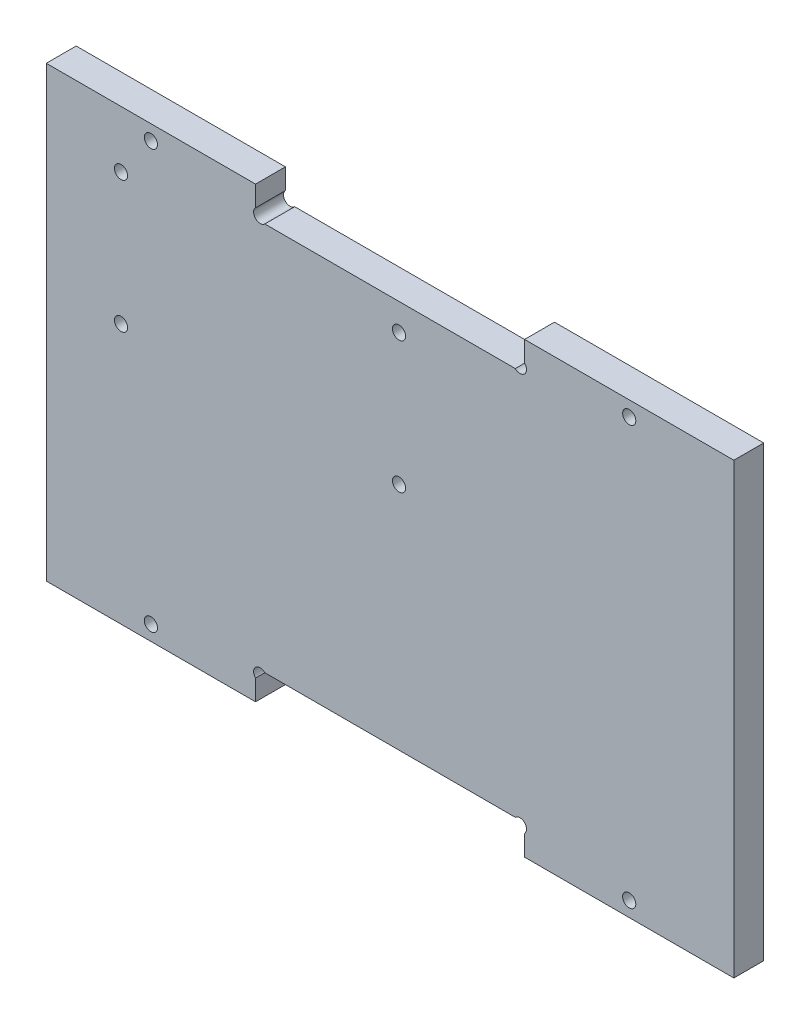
ISO-10303-21;
HEADER;
FILE_DESCRIPTION(('STEP AP214'),'2;1');
FILE_NAME('part.step','',(''),(''),'','','');
FILE_SCHEMA(('AUTOMOTIVE_DESIGN { 1 0 10303 214 1 1 1 1 }'));
ENDSEC;
DATA;
#1=APPLICATION_CONTEXT('core data for automotive mechanical design processes');
#2=APPLICATION_PROTOCOL_DEFINITION('international standard','automotive_design',2000,#1);
#3=PRODUCT_CONTEXT('',#1,'mechanical');
#4=PRODUCT('Part','Part','',(#3));
#5=PRODUCT_RELATED_PRODUCT_CATEGORY('part','',(#4));
#6=PRODUCT_DEFINITION_FORMATION('','',#4);
#7=PRODUCT_DEFINITION_CONTEXT('part definition',#1,'design');
#8=PRODUCT_DEFINITION('design','',#6,#7);
#9=PRODUCT_DEFINITION_SHAPE('','',#8);
#10=(LENGTH_UNIT() NAMED_UNIT(*) SI_UNIT(.MILLI.,.METRE.));
#11=(NAMED_UNIT(*) PLANE_ANGLE_UNIT() SI_UNIT($,.RADIAN.));
#12=(NAMED_UNIT(*) SI_UNIT($,.STERADIAN.) SOLID_ANGLE_UNIT());
#13=UNCERTAINTY_MEASURE_WITH_UNIT(LENGTH_MEASURE(1.E-05),#10,'distance_accuracy_value','');
#14=(GEOMETRIC_REPRESENTATION_CONTEXT(3) GLOBAL_UNCERTAINTY_ASSIGNED_CONTEXT((#13)) GLOBAL_UNIT_ASSIGNED_CONTEXT((#10,
#11,#12)) REPRESENTATION_CONTEXT('',''));
#15=CARTESIAN_POINT('',(0.,0.,0.));
#16=DIRECTION('',(0.,0.,1.));
#17=DIRECTION('',(1.,0.,0.));
#18=AXIS2_PLACEMENT_3D('',#15,#16,#17);
#19=CARTESIAN_POINT('',(0.,75.,5.));
#20=DIRECTION('',(0.,0.,-1.));
#21=DIRECTION('',(-1.,0.,0.));
#22=AXIS2_PLACEMENT_3D('',#19,#20,#21);
#23=PLANE('',#22);
#24=CARTESIAN_POINT('',(97.5,72.5,5.));
#25=DIRECTION('',(0.,0.,-1.));
#26=DIRECTION('',(-1.,0.,0.));
#27=AXIS2_PLACEMENT_3D('',#24,#25,#26);
#28=CIRCLE('',#27,1.1);
#29=CARTESIAN_POINT('',(96.4,72.5,5.));
#30=VERTEX_POINT('',#29);
#31=EDGE_CURVE('E319',#30,#30,#28,.T.);
#32=ORIENTED_EDGE('',*,*,#31,.T.);
#33=EDGE_LOOP('',(#32));
#34=FACE_BOUND('',#33,.T.);
#35=CARTESIAN_POINT('',(17.5,72.5,5.));
#36=DIRECTION('',(0.,0.,-1.));
#37=DIRECTION('',(-1.,0.,0.));
#38=AXIS2_PLACEMENT_3D('',#35,#36,#37);
#39=CIRCLE('',#38,1.1);
#40=CARTESIAN_POINT('',(16.4,72.5,5.));
#41=VERTEX_POINT('',#40);
#42=EDGE_CURVE('E162',#41,#41,#39,.F.);
#43=ORIENTED_EDGE('',*,*,#42,.F.);
#44=EDGE_LOOP('',(#43));
#45=FACE_BOUND('',#44,.T.);
#46=CARTESIAN_POINT('',(35.7778174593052,4.2221825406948,5.));
#47=DIRECTION('',(0.,0.,-1.));
#48=DIRECTION('',(-1.,0.,0.));
#49=AXIS2_PLACEMENT_3D('',#46,#47,#48);
#50=CIRCLE('',#49,1.1);
#51=CARTESIAN_POINT('',(36.5556349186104,5.,5.));
#52=VERTEX_POINT('',#51);
#53=CARTESIAN_POINT('',(35.,3.44436508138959,5.));
#54=VERTEX_POINT('',#53);
#55=EDGE_CURVE('E48',#52,#54,#50,.F.);
#56=ORIENTED_EDGE('',*,*,#55,.F.);
#57=DIRECTION('',(-1.,0.,0.));
#58=VECTOR('',#57,1.);
#59=CARTESIAN_POINT('',(80.,5.,5.));
#60=LINE('',#59,#58);
#61=CARTESIAN_POINT('',(78.4443650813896,5.,5.));
#62=VERTEX_POINT('',#61);
#63=EDGE_CURVE('E160',#62,#52,#60,.T.);
#64=ORIENTED_EDGE('',*,*,#63,.F.);
#65=CARTESIAN_POINT('',(79.2221825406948,4.22218254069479,5.));
#66=DIRECTION('',(0.,0.,-1.));
#67=DIRECTION('',(-1.,0.,0.));
#68=AXIS2_PLACEMENT_3D('',#65,#66,#67);
#69=CIRCLE('',#68,1.10000000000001);
#70=CARTESIAN_POINT('',(80.,3.44436508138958,5.));
#71=VERTEX_POINT('',#70);
#72=EDGE_CURVE('E56',#71,#62,#69,.F.);
#73=ORIENTED_EDGE('',*,*,#72,.F.);
#74=DIRECTION('',(0.,1.,0.));
#75=VECTOR('',#74,1.);
#76=CARTESIAN_POINT('',(80.,0.,5.));
#77=LINE('',#76,#75);
#78=CARTESIAN_POINT('',(80.,0.,5.));
#79=VERTEX_POINT('',#78);
#80=EDGE_CURVE('E277',#79,#71,#77,.T.);
#81=ORIENTED_EDGE('',*,*,#80,.F.);
#82=DIRECTION('',(1.,0.,0.));
#83=VECTOR('',#82,1.);
#84=CARTESIAN_POINT('',(0.,0.,5.));
#85=LINE('',#84,#83);
#86=CARTESIAN_POINT('',(115.,0.,5.));
#87=VERTEX_POINT('',#86);
#88=EDGE_CURVE('E228',#79,#87,#85,.T.);
#89=ORIENTED_EDGE('',*,*,#88,.T.);
#90=DIRECTION('',(0.,1.,0.));
#91=VECTOR('',#90,1.);
#92=CARTESIAN_POINT('',(115.,0.,5.));
#93=LINE('',#92,#91);
#94=CARTESIAN_POINT('',(115.,75.,5.));
#95=VERTEX_POINT('',#94);
#96=EDGE_CURVE('E233',#87,#95,#93,.T.);
#97=ORIENTED_EDGE('',*,*,#96,.T.);
#98=DIRECTION('',(-1.,0.,0.));
#99=VECTOR('',#98,1.);
#100=CARTESIAN_POINT('',(0.,75.,5.));
#101=LINE('',#100,#99);
#102=CARTESIAN_POINT('',(80.,75.,5.));
#103=VERTEX_POINT('',#102);
#104=EDGE_CURVE('E236',#95,#103,#101,.T.);
#105=ORIENTED_EDGE('',*,*,#104,.T.);
#106=DIRECTION('',(0.,1.,0.));
#107=VECTOR('',#106,1.);
#108=CARTESIAN_POINT('',(80.,75.,5.));
#109=LINE('',#108,#107);
#110=CARTESIAN_POINT('',(80.,71.5556349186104,5.));
#111=VERTEX_POINT('',#110);
#112=EDGE_CURVE('E183',#111,#103,#109,.T.);
#113=ORIENTED_EDGE('',*,*,#112,.F.);
#114=CARTESIAN_POINT('',(79.2221825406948,70.7778174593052,5.));
#115=DIRECTION('',(0.,0.,-1.));
#116=DIRECTION('',(-1.,0.,0.));
#117=AXIS2_PLACEMENT_3D('',#114,#115,#116);
#118=CIRCLE('',#117,1.10000000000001);
#119=CARTESIAN_POINT('',(78.4443650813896,70.,5.));
#120=VERTEX_POINT('',#119);
#121=EDGE_CURVE('E294',#120,#111,#118,.F.);
#122=ORIENTED_EDGE('',*,*,#121,.F.);
#123=DIRECTION('',(1.,0.,0.));
#124=VECTOR('',#123,1.);
#125=CARTESIAN_POINT('',(80.,70.,5.));
#126=LINE('',#125,#124);
#127=CARTESIAN_POINT('',(36.5556349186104,70.,5.));
#128=VERTEX_POINT('',#127);
#129=EDGE_CURVE('E195',#128,#120,#126,.T.);
#130=ORIENTED_EDGE('',*,*,#129,.F.);
#131=CARTESIAN_POINT('',(35.7778174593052,70.7778174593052,5.));
#132=DIRECTION('',(0.,0.,-1.));
#133=DIRECTION('',(-1.,0.,0.));
#134=AXIS2_PLACEMENT_3D('',#131,#132,#133);
#135=CIRCLE('',#134,1.1);
#136=CARTESIAN_POINT('',(35.,71.5556349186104,5.));
#137=VERTEX_POINT('',#136);
#138=EDGE_CURVE('E287',#137,#128,#135,.F.);
#139=ORIENTED_EDGE('',*,*,#138,.F.);
#140=DIRECTION('',(0.,-1.,0.));
#141=VECTOR('',#140,1.);
#142=CARTESIAN_POINT('',(35.,75.,5.));
#143=LINE('',#142,#141);
#144=CARTESIAN_POINT('',(35.,75.,5.));
#145=VERTEX_POINT('',#144);
#146=EDGE_CURVE('E179',#145,#137,#143,.T.);
#147=ORIENTED_EDGE('',*,*,#146,.F.);
#148=CARTESIAN_POINT('',(0.,75.,5.));
#149=VERTEX_POINT('',#148);
#150=EDGE_CURVE('E235',#145,#149,#101,.T.);
#151=ORIENTED_EDGE('',*,*,#150,.T.);
#152=DIRECTION('',(0.,-1.,0.));
#153=VECTOR('',#152,1.);
#154=CARTESIAN_POINT('',(0.,0.,5.));
#155=LINE('',#154,#153);
#156=CARTESIAN_POINT('',(0.,0.,5.));
#157=VERTEX_POINT('',#156);
#158=EDGE_CURVE('E225',#149,#157,#155,.T.);
#159=ORIENTED_EDGE('',*,*,#158,.T.);
#160=CARTESIAN_POINT('',(35.,0.,5.));
#161=VERTEX_POINT('',#160);
#162=EDGE_CURVE('E230',#157,#161,#85,.T.);
#163=ORIENTED_EDGE('',*,*,#162,.T.);
#164=DIRECTION('',(0.,-1.,0.));
#165=VECTOR('',#164,1.);
#166=CARTESIAN_POINT('',(35.,0.,5.));
#167=LINE('',#166,#165);
#168=EDGE_CURVE('E285',#54,#161,#167,.T.);
#169=ORIENTED_EDGE('',*,*,#168,.F.);
#170=EDGE_LOOP('',(#56,#64,#73,#81,#89,#97,#105,#113,#122,#130,#139,#147,#151,#159,#163,#169));
#171=FACE_BOUND('',#170,.T.);
#172=CARTESIAN_POINT('',(12.5,43.5,5.));
#173=DIRECTION('',(0.,0.,1.));
#174=DIRECTION('',(1.,0.,0.));
#175=AXIS2_PLACEMENT_3D('',#172,#173,#174);
#176=CIRCLE('',#175,1.1);
#177=CARTESIAN_POINT('',(13.6,43.5,5.));
#178=VERTEX_POINT('',#177);
#179=EDGE_CURVE('E201',#178,#178,#176,.T.);
#180=ORIENTED_EDGE('',*,*,#179,.F.);
#181=EDGE_LOOP('',(#180));
#182=FACE_BOUND('',#181,.T.);
#183=CARTESIAN_POINT('',(59.,43.5,5.));
#184=DIRECTION('',(0.,0.,1.));
#185=DIRECTION('',(1.,0.,0.));
#186=AXIS2_PLACEMENT_3D('',#183,#184,#185);
#187=CIRCLE('',#186,1.1);
#188=CARTESIAN_POINT('',(60.1,43.5,5.));
#189=VERTEX_POINT('',#188);
#190=EDGE_CURVE('E207',#189,#189,#187,.T.);
#191=ORIENTED_EDGE('',*,*,#190,.F.);
#192=EDGE_LOOP('',(#191));
#193=FACE_BOUND('',#192,.T.);
#194=CARTESIAN_POINT('',(59.,65.5,5.));
#195=DIRECTION('',(0.,0.,1.));
#196=DIRECTION('',(1.,0.,0.));
#197=AXIS2_PLACEMENT_3D('',#194,#195,#196);
#198=CIRCLE('',#197,1.10000000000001);
#199=CARTESIAN_POINT('',(60.1,65.5,5.));
#200=VERTEX_POINT('',#199);
#201=EDGE_CURVE('E213',#200,#200,#198,.T.);
#202=ORIENTED_EDGE('',*,*,#201,.F.);
#203=EDGE_LOOP('',(#202));
#204=FACE_BOUND('',#203,.T.);
#205=CARTESIAN_POINT('',(12.5,65.5,5.));
#206=DIRECTION('',(0.,0.,1.));
#207=DIRECTION('',(1.,0.,0.));
#208=AXIS2_PLACEMENT_3D('',#205,#206,#207);
#209=CIRCLE('',#208,1.1);
#210=CARTESIAN_POINT('',(13.6,65.5,5.));
#211=VERTEX_POINT('',#210);
#212=EDGE_CURVE('E219',#211,#211,#209,.T.);
#213=ORIENTED_EDGE('',*,*,#212,.F.);
#214=EDGE_LOOP('',(#213));
#215=FACE_BOUND('',#214,.T.);
#216=CARTESIAN_POINT('',(97.5,2.5,5.));
#217=DIRECTION('',(0.,0.,-1.));
#218=DIRECTION('',(-1.,0.,0.));
#219=AXIS2_PLACEMENT_3D('',#216,#217,#218);
#220=CIRCLE('',#219,1.1);
#221=CARTESIAN_POINT('',(96.4,2.5,5.));
#222=VERTEX_POINT('',#221);
#223=EDGE_CURVE('E322',#222,#222,#220,.F.);
#224=ORIENTED_EDGE('',*,*,#223,.F.);
#225=EDGE_LOOP('',(#224));
#226=FACE_BOUND('',#225,.T.);
#227=CARTESIAN_POINT('',(17.5,2.5,5.));
#228=DIRECTION('',(0.,0.,-1.));
#229=DIRECTION('',(-1.,0.,0.));
#230=AXIS2_PLACEMENT_3D('',#227,#228,#229);
#231=CIRCLE('',#230,1.1);
#232=CARTESIAN_POINT('',(16.4,2.5,5.));
#233=VERTEX_POINT('',#232);
#234=EDGE_CURVE('E331',#233,#233,#231,.T.);
#235=ORIENTED_EDGE('',*,*,#234,.T.);
#236=EDGE_LOOP('',(#235));
#237=FACE_BOUND('',#236,.T.);
#238=ADVANCED_FACE('F33',(#34,#45,#171,#182,#193,#204,#215,#226,#237),#23,.F.);
#239=CARTESIAN_POINT('',(0.,75.,0.));
#240=DIRECTION('',(0.,0.,-1.));
#241=DIRECTION('',(-1.,0.,0.));
#242=AXIS2_PLACEMENT_3D('',#239,#240,#241);
#243=PLANE('',#242);
#244=CARTESIAN_POINT('',(97.5,72.5,0.));
#245=DIRECTION('',(0.,0.,1.));
#246=DIRECTION('',(1.,0.,0.));
#247=AXIS2_PLACEMENT_3D('',#244,#245,#246);
#248=CIRCLE('',#247,1.1);
#249=CARTESIAN_POINT('',(98.6,72.5,0.));
#250=VERTEX_POINT('',#249);
#251=EDGE_CURVE('E318',#250,#250,#248,.T.);
#252=ORIENTED_EDGE('',*,*,#251,.T.);
#253=EDGE_LOOP('',(#252));
#254=FACE_BOUND('',#253,.T.);
#255=CARTESIAN_POINT('',(17.5,72.5,0.));
#256=DIRECTION('',(0.,0.,-1.));
#257=DIRECTION('',(-1.,0.,0.));
#258=AXIS2_PLACEMENT_3D('',#255,#256,#257);
#259=CIRCLE('',#258,1.1);
#260=CARTESIAN_POINT('',(16.4,72.5,0.));
#261=VERTEX_POINT('',#260);
#262=EDGE_CURVE('E315',#261,#261,#259,.T.);
#263=ORIENTED_EDGE('',*,*,#262,.F.);
#264=EDGE_LOOP('',(#263));
#265=FACE_BOUND('',#264,.T.);
#266=DIRECTION('',(1.,0.,0.));
#267=VECTOR('',#266,1.);
#268=CARTESIAN_POINT('',(80.,5.,0.));
#269=LINE('',#268,#267);
#270=CARTESIAN_POINT('',(36.5556349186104,5.,0.));
#271=VERTEX_POINT('',#270);
#272=CARTESIAN_POINT('',(78.4443650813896,5.,0.));
#273=VERTEX_POINT('',#272);
#274=EDGE_CURVE('E158',#271,#273,#269,.T.);
#275=ORIENTED_EDGE('',*,*,#274,.F.);
#276=CARTESIAN_POINT('',(35.7778174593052,4.2221825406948,0.));
#277=DIRECTION('',(0.,0.,-1.));
#278=DIRECTION('',(-1.,0.,0.));
#279=AXIS2_PLACEMENT_3D('',#276,#277,#278);
#280=CIRCLE('',#279,1.1);
#281=CARTESIAN_POINT('',(35.,3.44436508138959,0.));
#282=VERTEX_POINT('',#281);
#283=EDGE_CURVE('E145',#282,#271,#280,.T.);
#284=ORIENTED_EDGE('',*,*,#283,.F.);
#285=DIRECTION('',(0.,1.,0.));
#286=VECTOR('',#285,1.);
#287=CARTESIAN_POINT('',(35.,0.,0.));
#288=LINE('',#287,#286);
#289=CARTESIAN_POINT('',(35.,0.,0.));
#290=VERTEX_POINT('',#289);
#291=EDGE_CURVE('E170',#290,#282,#288,.T.);
#292=ORIENTED_EDGE('',*,*,#291,.F.);
#293=DIRECTION('',(1.,0.,0.));
#294=VECTOR('',#293,1.);
#295=CARTESIAN_POINT('',(0.,0.,0.));
#296=LINE('',#295,#294);
#297=CARTESIAN_POINT('',(0.,0.,0.));
#298=VERTEX_POINT('',#297);
#299=EDGE_CURVE('E243',#298,#290,#296,.T.);
#300=ORIENTED_EDGE('',*,*,#299,.F.);
#301=DIRECTION('',(0.,-1.,0.));
#302=VECTOR('',#301,1.);
#303=CARTESIAN_POINT('',(0.,0.,0.));
#304=LINE('',#303,#302);
#305=CARTESIAN_POINT('',(0.,75.,0.));
#306=VERTEX_POINT('',#305);
#307=EDGE_CURVE('E222',#306,#298,#304,.T.);
#308=ORIENTED_EDGE('',*,*,#307,.F.);
#309=DIRECTION('',(-1.,0.,0.));
#310=VECTOR('',#309,1.);
#311=CARTESIAN_POINT('',(0.,75.,0.));
#312=LINE('',#311,#310);
#313=CARTESIAN_POINT('',(35.,75.,0.));
#314=VERTEX_POINT('',#313);
#315=EDGE_CURVE('E248',#314,#306,#312,.T.);
#316=ORIENTED_EDGE('',*,*,#315,.F.);
#317=DIRECTION('',(0.,1.,0.));
#318=VECTOR('',#317,1.);
#319=CARTESIAN_POINT('',(35.,75.,0.));
#320=LINE('',#319,#318);
#321=CARTESIAN_POINT('',(35.,71.5556349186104,0.));
#322=VERTEX_POINT('',#321);
#323=EDGE_CURVE('E190',#322,#314,#320,.T.);
#324=ORIENTED_EDGE('',*,*,#323,.F.);
#325=CARTESIAN_POINT('',(35.7778174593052,70.7778174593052,0.));
#326=DIRECTION('',(0.,0.,-1.));
#327=DIRECTION('',(-1.,0.,0.));
#328=AXIS2_PLACEMENT_3D('',#325,#326,#327);
#329=CIRCLE('',#328,1.1);
#330=CARTESIAN_POINT('',(36.5556349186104,70.,0.));
#331=VERTEX_POINT('',#330);
#332=EDGE_CURVE('E289',#331,#322,#329,.T.);
#333=ORIENTED_EDGE('',*,*,#332,.F.);
#334=DIRECTION('',(-1.,0.,0.));
#335=VECTOR('',#334,1.);
#336=CARTESIAN_POINT('',(80.,70.,0.));
#337=LINE('',#336,#335);
#338=CARTESIAN_POINT('',(78.4443650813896,70.,0.));
#339=VERTEX_POINT('',#338);
#340=EDGE_CURVE('E188',#339,#331,#337,.T.);
#341=ORIENTED_EDGE('',*,*,#340,.F.);
#342=CARTESIAN_POINT('',(79.2221825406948,70.7778174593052,0.));
#343=DIRECTION('',(0.,0.,-1.));
#344=DIRECTION('',(-1.,0.,0.));
#345=AXIS2_PLACEMENT_3D('',#342,#343,#344);
#346=CIRCLE('',#345,1.10000000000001);
#347=CARTESIAN_POINT('',(80.,71.5556349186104,0.));
#348=VERTEX_POINT('',#347);
#349=EDGE_CURVE('E296',#348,#339,#346,.T.);
#350=ORIENTED_EDGE('',*,*,#349,.F.);
#351=DIRECTION('',(0.,-1.,0.));
#352=VECTOR('',#351,1.);
#353=CARTESIAN_POINT('',(80.,75.,0.));
#354=LINE('',#353,#352);
#355=CARTESIAN_POINT('',(80.,75.,0.));
#356=VERTEX_POINT('',#355);
#357=EDGE_CURVE('E185',#356,#348,#354,.T.);
#358=ORIENTED_EDGE('',*,*,#357,.F.);
#359=CARTESIAN_POINT('',(115.,75.,0.));
#360=VERTEX_POINT('',#359);
#361=EDGE_CURVE('E229',#360,#356,#312,.T.);
#362=ORIENTED_EDGE('',*,*,#361,.F.);
#363=DIRECTION('',(0.,1.,0.));
#364=VECTOR('',#363,1.);
#365=CARTESIAN_POINT('',(115.,0.,0.));
#366=LINE('',#365,#364);
#367=CARTESIAN_POINT('',(115.,0.,0.));
#368=VERTEX_POINT('',#367);
#369=EDGE_CURVE('E246',#368,#360,#366,.T.);
#370=ORIENTED_EDGE('',*,*,#369,.F.);
#371=CARTESIAN_POINT('',(80.,0.,0.));
#372=VERTEX_POINT('',#371);
#373=EDGE_CURVE('E242',#372,#368,#296,.T.);
#374=ORIENTED_EDGE('',*,*,#373,.F.);
#375=DIRECTION('',(0.,-1.,0.));
#376=VECTOR('',#375,1.);
#377=CARTESIAN_POINT('',(80.,0.,0.));
#378=LINE('',#377,#376);
#379=CARTESIAN_POINT('',(80.,3.44436508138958,0.));
#380=VERTEX_POINT('',#379);
#381=EDGE_CURVE('E175',#380,#372,#378,.T.);
#382=ORIENTED_EDGE('',*,*,#381,.F.);
#383=CARTESIAN_POINT('',(79.2221825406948,4.22218254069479,0.));
#384=DIRECTION('',(0.,0.,-1.));
#385=DIRECTION('',(-1.,0.,0.));
#386=AXIS2_PLACEMENT_3D('',#383,#384,#385);
#387=CIRCLE('',#386,1.10000000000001);
#388=EDGE_CURVE('E168',#273,#380,#387,.T.);
#389=ORIENTED_EDGE('',*,*,#388,.F.);
#390=EDGE_LOOP('',(#275,#284,#292,#300,#308,#316,#324,#333,#341,#350,#358,#362,#370,#374,#382,#389));
#391=FACE_BOUND('',#390,.T.);
#392=CARTESIAN_POINT('',(12.5,43.5,0.));
#393=DIRECTION('',(0.,0.,-1.));
#394=DIRECTION('',(-1.,0.,0.));
#395=AXIS2_PLACEMENT_3D('',#392,#393,#394);
#396=CIRCLE('',#395,1.1);
#397=CARTESIAN_POINT('',(11.4,43.5,0.));
#398=VERTEX_POINT('',#397);
#399=EDGE_CURVE('E200',#398,#398,#396,.F.);
#400=ORIENTED_EDGE('',*,*,#399,.T.);
#401=EDGE_LOOP('',(#400));
#402=FACE_BOUND('',#401,.T.);
#403=CARTESIAN_POINT('',(59.,43.5,0.));
#404=DIRECTION('',(0.,0.,-1.));
#405=DIRECTION('',(-1.,0.,0.));
#406=AXIS2_PLACEMENT_3D('',#403,#404,#405);
#407=CIRCLE('',#406,1.1);
#408=CARTESIAN_POINT('',(57.9,43.5,0.));
#409=VERTEX_POINT('',#408);
#410=EDGE_CURVE('E204',#409,#409,#407,.F.);
#411=ORIENTED_EDGE('',*,*,#410,.T.);
#412=EDGE_LOOP('',(#411));
#413=FACE_BOUND('',#412,.T.);
#414=CARTESIAN_POINT('',(59.,65.5,0.));
#415=DIRECTION('',(0.,0.,-1.));
#416=DIRECTION('',(-1.,0.,0.));
#417=AXIS2_PLACEMENT_3D('',#414,#415,#416);
#418=CIRCLE('',#417,1.10000000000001);
#419=CARTESIAN_POINT('',(57.9,65.5,0.));
#420=VERTEX_POINT('',#419);
#421=EDGE_CURVE('E210',#420,#420,#418,.F.);
#422=ORIENTED_EDGE('',*,*,#421,.T.);
#423=EDGE_LOOP('',(#422));
#424=FACE_BOUND('',#423,.T.);
#425=CARTESIAN_POINT('',(12.5,65.5,0.));
#426=DIRECTION('',(0.,0.,-1.));
#427=DIRECTION('',(-1.,0.,0.));
#428=AXIS2_PLACEMENT_3D('',#425,#426,#427);
#429=CIRCLE('',#428,1.1);
#430=CARTESIAN_POINT('',(11.4,65.5,0.));
#431=VERTEX_POINT('',#430);
#432=EDGE_CURVE('E216',#431,#431,#429,.F.);
#433=ORIENTED_EDGE('',*,*,#432,.T.);
#434=EDGE_LOOP('',(#433));
#435=FACE_BOUND('',#434,.T.);
#436=CARTESIAN_POINT('',(97.5,2.5,0.));
#437=DIRECTION('',(0.,0.,-1.));
#438=DIRECTION('',(1.,0.,0.));
#439=AXIS2_PLACEMENT_3D('',#436,#437,#438);
#440=CIRCLE('',#439,1.1);
#441=CARTESIAN_POINT('',(98.6,2.5,0.));
#442=VERTEX_POINT('',#441);
#443=EDGE_CURVE('E327',#442,#442,#440,.T.);
#444=ORIENTED_EDGE('',*,*,#443,.F.);
#445=EDGE_LOOP('',(#444));
#446=FACE_BOUND('',#445,.T.);
#447=CARTESIAN_POINT('',(17.5,2.5,0.));
#448=DIRECTION('',(0.,0.,1.));
#449=DIRECTION('',(-1.,0.,0.));
#450=AXIS2_PLACEMENT_3D('',#447,#448,#449);
#451=CIRCLE('',#450,1.1);
#452=CARTESIAN_POINT('',(16.4,2.5,0.));
#453=VERTEX_POINT('',#452);
#454=EDGE_CURVE('E330',#453,#453,#451,.T.);
#455=ORIENTED_EDGE('',*,*,#454,.T.);
#456=EDGE_LOOP('',(#455));
#457=FACE_BOUND('',#456,.T.);
#458=ADVANCED_FACE('F165',(#254,#265,#391,#402,#413,#424,#435,#446,#457),#243,.T.);
#459=CARTESIAN_POINT('',(0.,0.,5.));
#460=DIRECTION('',(0.,1.,0.));
#461=DIRECTION('',(0.,0.,1.));
#462=AXIS2_PLACEMENT_3D('',#459,#460,#461);
#463=PLANE('',#462);
#464=ORIENTED_EDGE('',*,*,#88,.F.);
#465=DIRECTION('',(0.,0.,-1.));
#466=VECTOR('',#465,1.);
#467=CARTESIAN_POINT('',(80.,0.,5.001));
#468=LINE('',#467,#466);
#469=EDGE_CURVE('E169',#79,#372,#468,.T.);
#470=ORIENTED_EDGE('',*,*,#469,.T.);
#471=ORIENTED_EDGE('',*,*,#373,.T.);
#472=DIRECTION('',(0.,0.,-1.));
#473=VECTOR('',#472,1.);
#474=CARTESIAN_POINT('',(115.,0.,5.));
#475=LINE('',#474,#473);
#476=EDGE_CURVE('E41',#87,#368,#475,.T.);
#477=ORIENTED_EDGE('',*,*,#476,.F.);
#478=EDGE_LOOP('',(#464,#470,#471,#477));
#479=FACE_BOUND('',#478,.T.);
#480=ADVANCED_FACE('F278',(#479),#463,.F.);
#481=CARTESIAN_POINT('',(0.,75.,5.));
#482=DIRECTION('',(0.,-1.,0.));
#483=DIRECTION('',(0.,0.,-1.));
#484=AXIS2_PLACEMENT_3D('',#481,#482,#483);
#485=PLANE('',#484);
#486=ORIENTED_EDGE('',*,*,#361,.T.);
#487=DIRECTION('',(0.,0.,-1.));
#488=VECTOR('',#487,1.);
#489=CARTESIAN_POINT('',(80.,75.,5.001));
#490=LINE('',#489,#488);
#491=EDGE_CURVE('E193',#103,#356,#490,.T.);
#492=ORIENTED_EDGE('',*,*,#491,.F.);
#493=ORIENTED_EDGE('',*,*,#104,.F.);
#494=DIRECTION('',(0.,0.,-1.));
#495=VECTOR('',#494,1.);
#496=CARTESIAN_POINT('',(115.,75.,5.));
#497=LINE('',#496,#495);
#498=EDGE_CURVE('E253',#95,#360,#497,.T.);
#499=ORIENTED_EDGE('',*,*,#498,.T.);
#500=EDGE_LOOP('',(#486,#492,#493,#499));
#501=FACE_BOUND('',#500,.T.);
#502=ADVANCED_FACE('F269',(#501),#485,.F.);
#503=CARTESIAN_POINT('',(0.,0.,5.));
#504=DIRECTION('',(1.,0.,0.));
#505=DIRECTION('',(0.,0.,-1.));
#506=AXIS2_PLACEMENT_3D('',#503,#504,#505);
#507=PLANE('',#506);
#508=ORIENTED_EDGE('',*,*,#307,.T.);
#509=DIRECTION('',(0.,0.,-1.));
#510=VECTOR('',#509,1.);
#511=CARTESIAN_POINT('',(0.,0.,5.));
#512=LINE('',#511,#510);
#513=EDGE_CURVE('E11',#157,#298,#512,.T.);
#514=ORIENTED_EDGE('',*,*,#513,.F.);
#515=ORIENTED_EDGE('',*,*,#158,.F.);
#516=DIRECTION('',(0.,0.,-1.));
#517=VECTOR('',#516,1.);
#518=CARTESIAN_POINT('',(0.,75.,5.));
#519=LINE('',#518,#517);
#520=EDGE_CURVE('E239',#149,#306,#519,.T.);
#521=ORIENTED_EDGE('',*,*,#520,.T.);
#522=EDGE_LOOP('',(#508,#514,#515,#521));
#523=FACE_BOUND('',#522,.T.);
#524=ADVANCED_FACE('F35',(#523),#507,.F.);
#525=ORIENTED_EDGE('',*,*,#299,.T.);
#526=DIRECTION('',(0.,0.,-1.));
#527=VECTOR('',#526,1.);
#528=CARTESIAN_POINT('',(35.,0.,5.001));
#529=LINE('',#528,#527);
#530=EDGE_CURVE('E173',#161,#290,#529,.T.);
#531=ORIENTED_EDGE('',*,*,#530,.F.);
#532=ORIENTED_EDGE('',*,*,#162,.F.);
#533=ORIENTED_EDGE('',*,*,#513,.T.);
#534=EDGE_LOOP('',(#525,#531,#532,#533));
#535=FACE_BOUND('',#534,.T.);
#536=ADVANCED_FACE('F363',(#535),#463,.F.);
#537=CARTESIAN_POINT('',(115.,0.,5.));
#538=DIRECTION('',(-1.,0.,0.));
#539=DIRECTION('',(0.,0.,1.));
#540=AXIS2_PLACEMENT_3D('',#537,#538,#539);
#541=PLANE('',#540);
#542=ORIENTED_EDGE('',*,*,#369,.T.);
#543=ORIENTED_EDGE('',*,*,#498,.F.);
#544=ORIENTED_EDGE('',*,*,#96,.F.);
#545=ORIENTED_EDGE('',*,*,#476,.T.);
#546=EDGE_LOOP('',(#542,#543,#544,#545));
#547=FACE_BOUND('',#546,.T.);
#548=ADVANCED_FACE('F260',(#547),#541,.F.);
#549=ORIENTED_EDGE('',*,*,#150,.F.);
#550=DIRECTION('',(0.,0.,-1.));
#551=VECTOR('',#550,1.);
#552=CARTESIAN_POINT('',(35.,75.,5.001));
#553=LINE('',#552,#551);
#554=EDGE_CURVE('E192',#145,#314,#553,.T.);
#555=ORIENTED_EDGE('',*,*,#554,.T.);
#556=ORIENTED_EDGE('',*,*,#315,.T.);
#557=ORIENTED_EDGE('',*,*,#520,.F.);
#558=EDGE_LOOP('',(#549,#555,#556,#557));
#559=FACE_BOUND('',#558,.T.);
#560=ADVANCED_FACE('F358',(#559),#485,.F.);
#561=CARTESIAN_POINT('',(12.5,65.5,-0.00100000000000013));
#562=DIRECTION('',(0.,0.,1.));
#563=DIRECTION('',(1.,0.,0.));
#564=AXIS2_PLACEMENT_3D('',#561,#562,#563);
#565=CYLINDRICAL_SURFACE('',#564,1.1);
#566=ORIENTED_EDGE('',*,*,#432,.F.);
#567=EDGE_LOOP('',(#566));
#568=FACE_BOUND('',#567,.T.);
#569=ORIENTED_EDGE('',*,*,#212,.T.);
#570=EDGE_LOOP('',(#569));
#571=FACE_BOUND('',#570,.T.);
#572=ADVANCED_FACE('F355',(#568,#571),#565,.F.);
#573=CARTESIAN_POINT('',(59.,65.5,-0.00100000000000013));
#574=DIRECTION('',(0.,0.,1.));
#575=DIRECTION('',(1.,0.,0.));
#576=AXIS2_PLACEMENT_3D('',#573,#574,#575);
#577=CYLINDRICAL_SURFACE('',#576,1.10000000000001);
#578=ORIENTED_EDGE('',*,*,#421,.F.);
#579=EDGE_LOOP('',(#578));
#580=FACE_BOUND('',#579,.T.);
#581=ORIENTED_EDGE('',*,*,#201,.T.);
#582=EDGE_LOOP('',(#581));
#583=FACE_BOUND('',#582,.T.);
#584=ADVANCED_FACE('F397',(#580,#583),#577,.F.);
#585=CARTESIAN_POINT('',(59.,43.5,-0.00100000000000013));
#586=DIRECTION('',(0.,0.,1.));
#587=DIRECTION('',(1.,0.,0.));
#588=AXIS2_PLACEMENT_3D('',#585,#586,#587);
#589=CYLINDRICAL_SURFACE('',#588,1.1);
#590=ORIENTED_EDGE('',*,*,#410,.F.);
#591=EDGE_LOOP('',(#590));
#592=FACE_BOUND('',#591,.T.);
#593=ORIENTED_EDGE('',*,*,#190,.T.);
#594=EDGE_LOOP('',(#593));
#595=FACE_BOUND('',#594,.T.);
#596=ADVANCED_FACE('F406',(#592,#595),#589,.F.);
#597=CARTESIAN_POINT('',(12.5,43.5,-0.00100000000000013));
#598=DIRECTION('',(0.,0.,1.));
#599=DIRECTION('',(1.,0.,0.));
#600=AXIS2_PLACEMENT_3D('',#597,#598,#599);
#601=CYLINDRICAL_SURFACE('',#600,1.1);
#602=ORIENTED_EDGE('',*,*,#399,.F.);
#603=EDGE_LOOP('',(#602));
#604=FACE_BOUND('',#603,.T.);
#605=ORIENTED_EDGE('',*,*,#179,.T.);
#606=EDGE_LOOP('',(#605));
#607=FACE_BOUND('',#606,.T.);
#608=ADVANCED_FACE('F415',(#604,#607),#601,.F.);
#609=CARTESIAN_POINT('',(80.,75.,5.001));
#610=DIRECTION('',(1.,0.,0.));
#611=DIRECTION('',(0.,0.,-1.));
#612=AXIS2_PLACEMENT_3D('',#609,#610,#611);
#613=PLANE('',#612);
#614=ORIENTED_EDGE('',*,*,#357,.T.);
#615=DIRECTION('',(0.,0.,-1.));
#616=VECTOR('',#615,1.);
#617=CARTESIAN_POINT('',(80.,71.5556349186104,5.001));
#618=LINE('',#617,#616);
#619=EDGE_CURVE('E309',#111,#348,#618,.T.);
#620=ORIENTED_EDGE('',*,*,#619,.F.);
#621=ORIENTED_EDGE('',*,*,#112,.T.);
#622=ORIENTED_EDGE('',*,*,#491,.T.);
#623=EDGE_LOOP('',(#614,#620,#621,#622));
#624=FACE_BOUND('',#623,.T.);
#625=ADVANCED_FACE('F424',(#624),#613,.F.);
#626=CARTESIAN_POINT('',(35.,75.,5.001));
#627=DIRECTION('',(-1.,0.,0.));
#628=DIRECTION('',(0.,0.,1.));
#629=AXIS2_PLACEMENT_3D('',#626,#627,#628);
#630=PLANE('',#629);
#631=ORIENTED_EDGE('',*,*,#146,.T.);
#632=DIRECTION('',(0.,0.,-1.));
#633=VECTOR('',#632,1.);
#634=CARTESIAN_POINT('',(35.,71.5556349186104,5.001));
#635=LINE('',#634,#633);
#636=EDGE_CURVE('E306',#322,#137,#635,.F.);
#637=ORIENTED_EDGE('',*,*,#636,.F.);
#638=ORIENTED_EDGE('',*,*,#323,.T.);
#639=ORIENTED_EDGE('',*,*,#554,.F.);
#640=EDGE_LOOP('',(#631,#637,#638,#639));
#641=FACE_BOUND('',#640,.T.);
#642=ADVANCED_FACE('F442',(#641),#630,.F.);
#643=CARTESIAN_POINT('',(80.,70.,5.001));
#644=DIRECTION('',(0.,-1.,0.));
#645=DIRECTION('',(0.,0.,-1.));
#646=AXIS2_PLACEMENT_3D('',#643,#644,#645);
#647=PLANE('',#646);
#648=ORIENTED_EDGE('',*,*,#129,.T.);
#649=DIRECTION('',(0.,0.,-1.));
#650=VECTOR('',#649,1.);
#651=CARTESIAN_POINT('',(78.4443650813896,70.,5.001));
#652=LINE('',#651,#650);
#653=EDGE_CURVE('E298',#339,#120,#652,.F.);
#654=ORIENTED_EDGE('',*,*,#653,.F.);
#655=ORIENTED_EDGE('',*,*,#340,.T.);
#656=DIRECTION('',(0.,0.,-1.));
#657=VECTOR('',#656,1.);
#658=CARTESIAN_POINT('',(36.5556349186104,70.,5.001));
#659=LINE('',#658,#657);
#660=EDGE_CURVE('E291',#128,#331,#659,.T.);
#661=ORIENTED_EDGE('',*,*,#660,.F.);
#662=EDGE_LOOP('',(#648,#654,#655,#661));
#663=FACE_BOUND('',#662,.T.);
#664=ADVANCED_FACE('F452',(#663),#647,.F.);
#665=CARTESIAN_POINT('',(80.,0.,5.001));
#666=DIRECTION('',(1.,0.,0.));
#667=DIRECTION('',(0.,0.,-1.));
#668=AXIS2_PLACEMENT_3D('',#665,#666,#667);
#669=PLANE('',#668);
#670=ORIENTED_EDGE('',*,*,#80,.T.);
#671=DIRECTION('',(0.,0.,-1.));
#672=VECTOR('',#671,1.);
#673=CARTESIAN_POINT('',(80.,3.44436508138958,5.001));
#674=LINE('',#673,#672);
#675=EDGE_CURVE('E161',#380,#71,#674,.F.);
#676=ORIENTED_EDGE('',*,*,#675,.F.);
#677=ORIENTED_EDGE('',*,*,#381,.T.);
#678=ORIENTED_EDGE('',*,*,#469,.F.);
#679=EDGE_LOOP('',(#670,#676,#677,#678));
#680=FACE_BOUND('',#679,.T.);
#681=ADVANCED_FACE('F280',(#680),#669,.F.);
#682=CARTESIAN_POINT('',(80.,5.,5.001));
#683=DIRECTION('',(0.,1.,0.));
#684=DIRECTION('',(0.,0.,1.));
#685=AXIS2_PLACEMENT_3D('',#682,#683,#684);
#686=PLANE('',#685);
#687=ORIENTED_EDGE('',*,*,#63,.T.);
#688=DIRECTION('',(0.,0.,-1.));
#689=VECTOR('',#688,1.);
#690=CARTESIAN_POINT('',(36.5556349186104,5.,5.001));
#691=LINE('',#690,#689);
#692=EDGE_CURVE('E148',#271,#52,#691,.F.);
#693=ORIENTED_EDGE('',*,*,#692,.F.);
#694=ORIENTED_EDGE('',*,*,#274,.T.);
#695=DIRECTION('',(0.,0.,-1.));
#696=VECTOR('',#695,1.);
#697=CARTESIAN_POINT('',(78.4443650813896,5.,5.001));
#698=LINE('',#697,#696);
#699=EDGE_CURVE('E302',#62,#273,#698,.T.);
#700=ORIENTED_EDGE('',*,*,#699,.F.);
#701=EDGE_LOOP('',(#687,#693,#694,#700));
#702=FACE_BOUND('',#701,.T.);
#703=ADVANCED_FACE('F157',(#702),#686,.F.);
#704=CARTESIAN_POINT('',(35.,0.,5.001));
#705=DIRECTION('',(-1.,0.,0.));
#706=DIRECTION('',(0.,0.,1.));
#707=AXIS2_PLACEMENT_3D('',#704,#705,#706);
#708=PLANE('',#707);
#709=ORIENTED_EDGE('',*,*,#291,.T.);
#710=DIRECTION('',(0.,0.,-1.));
#711=VECTOR('',#710,1.);
#712=CARTESIAN_POINT('',(35.,3.44436508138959,5.001));
#713=LINE('',#712,#711);
#714=EDGE_CURVE('E150',#54,#282,#713,.T.);
#715=ORIENTED_EDGE('',*,*,#714,.F.);
#716=ORIENTED_EDGE('',*,*,#168,.T.);
#717=ORIENTED_EDGE('',*,*,#530,.T.);
#718=EDGE_LOOP('',(#709,#715,#716,#717));
#719=FACE_BOUND('',#718,.T.);
#720=ADVANCED_FACE('F476',(#719),#708,.F.);
#721=CARTESIAN_POINT('',(35.7778174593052,70.7778174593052,5.001));
#722=DIRECTION('',(0.,0.,-1.));
#723=DIRECTION('',(-1.,0.,0.));
#724=AXIS2_PLACEMENT_3D('',#721,#722,#723);
#725=CYLINDRICAL_SURFACE('',#724,1.1);
#726=ORIENTED_EDGE('',*,*,#332,.T.);
#727=ORIENTED_EDGE('',*,*,#636,.T.);
#728=ORIENTED_EDGE('',*,*,#138,.T.);
#729=ORIENTED_EDGE('',*,*,#660,.T.);
#730=EDGE_LOOP('',(#726,#727,#728,#729));
#731=FACE_BOUND('',#730,.T.);
#732=ADVANCED_FACE('F484',(#731),#725,.F.);
#733=CARTESIAN_POINT('',(79.2221825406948,70.7778174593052,5.001));
#734=DIRECTION('',(0.,0.,-1.));
#735=DIRECTION('',(-1.,0.,0.));
#736=AXIS2_PLACEMENT_3D('',#733,#734,#735);
#737=CYLINDRICAL_SURFACE('',#736,1.10000000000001);
#738=ORIENTED_EDGE('',*,*,#121,.T.);
#739=ORIENTED_EDGE('',*,*,#619,.T.);
#740=ORIENTED_EDGE('',*,*,#349,.T.);
#741=ORIENTED_EDGE('',*,*,#653,.T.);
#742=EDGE_LOOP('',(#738,#739,#740,#741));
#743=FACE_BOUND('',#742,.T.);
#744=ADVANCED_FACE('F493',(#743),#737,.F.);
#745=CARTESIAN_POINT('',(79.2221825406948,4.22218254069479,5.001));
#746=DIRECTION('',(0.,0.,-1.));
#747=DIRECTION('',(-1.,0.,0.));
#748=AXIS2_PLACEMENT_3D('',#745,#746,#747);
#749=CYLINDRICAL_SURFACE('',#748,1.10000000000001);
#750=ORIENTED_EDGE('',*,*,#388,.T.);
#751=ORIENTED_EDGE('',*,*,#675,.T.);
#752=ORIENTED_EDGE('',*,*,#72,.T.);
#753=ORIENTED_EDGE('',*,*,#699,.T.);
#754=EDGE_LOOP('',(#750,#751,#752,#753));
#755=FACE_BOUND('',#754,.T.);
#756=ADVANCED_FACE('F505',(#755),#749,.F.);
#757=CARTESIAN_POINT('',(35.7778174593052,4.2221825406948,5.001));
#758=DIRECTION('',(0.,0.,-1.));
#759=DIRECTION('',(-1.,0.,0.));
#760=AXIS2_PLACEMENT_3D('',#757,#758,#759);
#761=CYLINDRICAL_SURFACE('',#760,1.1);
#762=ORIENTED_EDGE('',*,*,#283,.T.);
#763=ORIENTED_EDGE('',*,*,#692,.T.);
#764=ORIENTED_EDGE('',*,*,#55,.T.);
#765=ORIENTED_EDGE('',*,*,#714,.T.);
#766=EDGE_LOOP('',(#762,#763,#764,#765));
#767=FACE_BOUND('',#766,.T.);
#768=ADVANCED_FACE('F147',(#767),#761,.F.);
#769=CARTESIAN_POINT('',(17.5,72.5,5.001));
#770=DIRECTION('',(0.,0.,-1.));
#771=DIRECTION('',(-1.,0.,0.));
#772=AXIS2_PLACEMENT_3D('',#769,#770,#771);
#773=CYLINDRICAL_SURFACE('',#772,1.1);
#774=ORIENTED_EDGE('',*,*,#262,.T.);
#775=EDGE_LOOP('',(#774));
#776=FACE_BOUND('',#775,.T.);
#777=ORIENTED_EDGE('',*,*,#42,.T.);
#778=EDGE_LOOP('',(#777));
#779=FACE_BOUND('',#778,.T.);
#780=ADVANCED_FACE('F527',(#776,#779),#773,.F.);
#781=CARTESIAN_POINT('',(97.5,72.5,5.001));
#782=DIRECTION('',(0.,0.,-1.));
#783=DIRECTION('',(-1.,0.,0.));
#784=AXIS2_PLACEMENT_3D('',#781,#782,#783);
#785=CYLINDRICAL_SURFACE('',#784,1.1);
#786=ORIENTED_EDGE('',*,*,#251,.F.);
#787=EDGE_LOOP('',(#786));
#788=FACE_BOUND('',#787,.T.);
#789=ORIENTED_EDGE('',*,*,#31,.F.);
#790=EDGE_LOOP('',(#789));
#791=FACE_BOUND('',#790,.T.);
#792=ADVANCED_FACE('F538',(#788,#791),#785,.F.);
#793=CARTESIAN_POINT('',(97.5,2.5,5.001));
#794=DIRECTION('',(0.,0.,-1.));
#795=DIRECTION('',(-1.,0.,0.));
#796=AXIS2_PLACEMENT_3D('',#793,#794,#795);
#797=CYLINDRICAL_SURFACE('',#796,1.1);
#798=ORIENTED_EDGE('',*,*,#443,.T.);
#799=EDGE_LOOP('',(#798));
#800=FACE_BOUND('',#799,.T.);
#801=ORIENTED_EDGE('',*,*,#223,.T.);
#802=EDGE_LOOP('',(#801));
#803=FACE_BOUND('',#802,.T.);
#804=ADVANCED_FACE('F341',(#800,#803),#797,.F.);
#805=CARTESIAN_POINT('',(17.5,2.5,5.001));
#806=DIRECTION('',(0.,0.,-1.));
#807=DIRECTION('',(-1.,0.,0.));
#808=AXIS2_PLACEMENT_3D('',#805,#806,#807);
#809=CYLINDRICAL_SURFACE('',#808,1.1);
#810=ORIENTED_EDGE('',*,*,#454,.F.);
#811=EDGE_LOOP('',(#810));
#812=FACE_BOUND('',#811,.T.);
#813=ORIENTED_EDGE('',*,*,#234,.F.);
#814=EDGE_LOOP('',(#813));
#815=FACE_BOUND('',#814,.T.);
#816=ADVANCED_FACE('F338',(#812,#815),#809,.F.);
#817=CLOSED_SHELL('',(#238,#458,#480,#502,#524,#536,#548,#560,#572,#584,#596,#608,#625,#642,
#664,#681,#703,#720,#732,#744,#756,#768,#780,#792,#804,#816));
#818=MANIFOLD_SOLID_BREP('B2',#817);
#819=ADVANCED_BREP_SHAPE_REPRESENTATION('',(#18,#818),#14);
#820=SHAPE_DEFINITION_REPRESENTATION(#9,#819);
ENDSEC;
END-ISO-10303-21;
